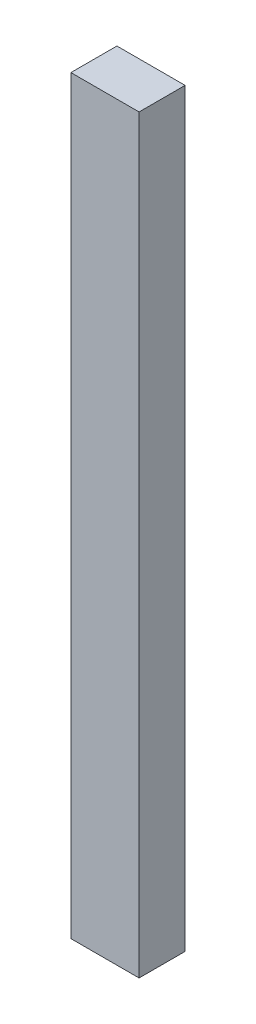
from build123d import *

# Parameters (mm, degrees)
ESQUISSE1_W        = 40
ESQUISSE1_H        = 440
BOSS_EXTRU_1_DEPTH = 27


with BuildPart() as part:
    # Esquisse1 → Boss.-Extru.1 (new body)
    with BuildSketch(Plane.XY):
        with Locations((430, 260)):
            Rectangle(ESQUISSE1_W, ESQUISSE1_H)
    extrude(amount=-BOSS_EXTRU_1_DEPTH)


solid = part.part
